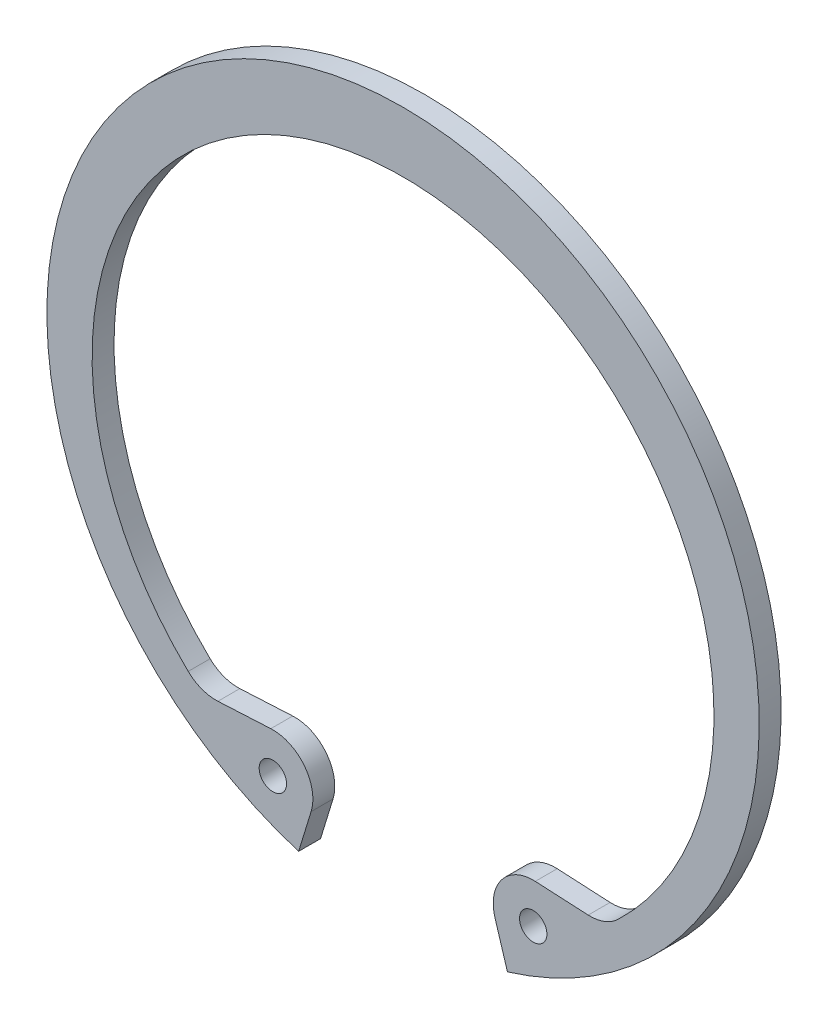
ISO-10303-21;
HEADER;
FILE_DESCRIPTION(('STEP AP214'),'2;1');
FILE_NAME('part.step','',(''),(''),'','','');
FILE_SCHEMA(('AUTOMOTIVE_DESIGN { 1 0 10303 214 1 1 1 1 }'));
ENDSEC;
DATA;
#1=APPLICATION_CONTEXT('core data for automotive mechanical design processes');
#2=APPLICATION_PROTOCOL_DEFINITION('international standard','automotive_design',2000,#1);
#3=PRODUCT_CONTEXT('',#1,'mechanical');
#4=PRODUCT('Part','Part','',(#3));
#5=PRODUCT_RELATED_PRODUCT_CATEGORY('part','',(#4));
#6=PRODUCT_DEFINITION_FORMATION('','',#4);
#7=PRODUCT_DEFINITION_CONTEXT('part definition',#1,'design');
#8=PRODUCT_DEFINITION('design','',#6,#7);
#9=PRODUCT_DEFINITION_SHAPE('','',#8);
#10=(LENGTH_UNIT() NAMED_UNIT(*) SI_UNIT(.MILLI.,.METRE.));
#11=(NAMED_UNIT(*) PLANE_ANGLE_UNIT() SI_UNIT($,.RADIAN.));
#12=(NAMED_UNIT(*) SI_UNIT($,.STERADIAN.) SOLID_ANGLE_UNIT());
#13=UNCERTAINTY_MEASURE_WITH_UNIT(LENGTH_MEASURE(1.E-05),#10,'distance_accuracy_value','');
#14=(GEOMETRIC_REPRESENTATION_CONTEXT(3) GLOBAL_UNCERTAINTY_ASSIGNED_CONTEXT((#13)) GLOBAL_UNIT_ASSIGNED_CONTEXT((#10,
#11,#12)) REPRESENTATION_CONTEXT('',''));
#15=CARTESIAN_POINT('',(0.,0.,0.));
#16=DIRECTION('',(0.,0.,1.));
#17=DIRECTION('',(1.,0.,0.));
#18=AXIS2_PLACEMENT_3D('',#15,#16,#17);
#19=CARTESIAN_POINT('',(0.,0.,2.));
#20=DIRECTION('',(0.,0.,1.));
#21=DIRECTION('',(1.,0.,0.));
#22=AXIS2_PLACEMENT_3D('',#19,#20,#21);
#23=PLANE('',#22);
#24=CARTESIAN_POINT('',(11.8788394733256,-26.2909808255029,2.));
#25=DIRECTION('',(0.,0.,1.));
#26=DIRECTION('',(1.,0.,0.));
#27=AXIS2_PLACEMENT_3D('',#24,#25,#26);
#28=CIRCLE('',#27,1.25);
#29=CARTESIAN_POINT('',(10.6288394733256,-26.2909808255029,2.));
#30=VERTEX_POINT('',#29);
#31=EDGE_CURVE('E145',#30,#30,#28,.T.);
#32=ORIENTED_EDGE('',*,*,#31,.F.);
#33=EDGE_LOOP('',(#32));
#34=FACE_BOUND('',#33,.T.);
#35=CARTESIAN_POINT('',(0.,0.,2.));
#36=DIRECTION('',(0.,0.,1.));
#37=DIRECTION('',(1.,0.,0.));
#38=AXIS2_PLACEMENT_3D('',#35,#36,#37);
#39=CIRCLE('',#38,32.5);
#40=CARTESIAN_POINT('',(9.52711331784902,-31.0722402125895,2.));
#41=VERTEX_POINT('',#40);
#42=CARTESIAN_POINT('',(-9.52711331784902,-31.0722402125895,2.));
#43=VERTEX_POINT('',#42);
#44=EDGE_CURVE('E160',#41,#43,#39,.T.);
#45=ORIENTED_EDGE('',*,*,#44,.T.);
#46=DIRECTION('',(0.293141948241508,0.956068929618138,0.));
#47=VECTOR('',#46,1.);
#48=CARTESIAN_POINT('',(-8.38918788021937,-27.3609489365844,2.));
#49=LINE('',#48,#47);
#50=CARTESIAN_POINT('',(-8.38918788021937,-27.3609489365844,2.));
#51=VERTEX_POINT('',#50);
#52=EDGE_CURVE('E98',#43,#51,#49,.T.);
#53=ORIENTED_EDGE('',*,*,#52,.T.);
#54=CARTESIAN_POINT('',(-11.8788394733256,-26.2909808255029,2.));
#55=DIRECTION('',(0.,0.,1.));
#56=DIRECTION('',(-1.,0.,0.));
#57=AXIS2_PLACEMENT_3D('',#54,#55,#56);
#58=CIRCLE('',#57,3.65);
#59=CARTESIAN_POINT('',(-12.0669294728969,-22.6458303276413,2.));
#60=VERTEX_POINT('',#59);
#61=EDGE_CURVE('E181',#51,#60,#58,.T.);
#62=ORIENTED_EDGE('',*,*,#61,.T.);
#63=DIRECTION('',(-0.998671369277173,-0.0515315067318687,0.));
#64=VECTOR('',#63,1.);
#65=CARTESIAN_POINT('',(-16.8945801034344,-22.8949374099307,2.));
#66=LINE('',#65,#64);
#67=CARTESIAN_POINT('',(-16.8945801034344,-22.8949374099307,2.));
#68=VERTEX_POINT('',#67);
#69=EDGE_CURVE('E200',#60,#68,#66,.T.);
#70=ORIENTED_EDGE('',*,*,#69,.T.);
#71=CARTESIAN_POINT('',(-17.0826701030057,-19.249786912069,2.));
#72=DIRECTION('',(0.,0.,-1.));
#73=DIRECTION('',(-1.,0.,0.));
#74=AXIS2_PLACEMENT_3D('',#71,#72,#73);
#75=CIRCLE('',#74,3.65000000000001);
#76=CARTESIAN_POINT('',(-19.6044798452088,-21.8885319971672,2.));
#77=VERTEX_POINT('',#76);
#78=EDGE_CURVE('E197',#68,#77,#75,.T.);
#79=ORIENTED_EDGE('',*,*,#78,.T.);
#80=CARTESIAN_POINT('',(0.,-1.37499999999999,2.));
#81=DIRECTION('',(0.,0.,-1.));
#82=DIRECTION('',(1.,0.,0.));
#83=AXIS2_PLACEMENT_3D('',#80,#81,#82);
#84=CIRCLE('',#83,28.375);
#85=CARTESIAN_POINT('',(19.6044798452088,-21.8885319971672,2.));
#86=VERTEX_POINT('',#85);
#87=EDGE_CURVE('E199',#77,#86,#84,.T.);
#88=ORIENTED_EDGE('',*,*,#87,.T.);
#89=CARTESIAN_POINT('',(17.0826701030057,-19.249786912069,2.));
#90=DIRECTION('',(0.,0.,-1.));
#91=DIRECTION('',(1.,0.,0.));
#92=AXIS2_PLACEMENT_3D('',#89,#90,#91);
#93=CIRCLE('',#92,3.65000000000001);
#94=CARTESIAN_POINT('',(16.8945801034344,-22.8949374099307,2.));
#95=VERTEX_POINT('',#94);
#96=EDGE_CURVE('E123',#86,#95,#93,.T.);
#97=ORIENTED_EDGE('',*,*,#96,.T.);
#98=DIRECTION('',(-0.998671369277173,0.0515315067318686,0.));
#99=VECTOR('',#98,1.);
#100=CARTESIAN_POINT('',(16.8945801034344,-22.8949374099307,2.));
#101=LINE('',#100,#99);
#102=CARTESIAN_POINT('',(12.0669294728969,-22.6458303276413,2.));
#103=VERTEX_POINT('',#102);
#104=EDGE_CURVE('E117',#95,#103,#101,.T.);
#105=ORIENTED_EDGE('',*,*,#104,.T.);
#106=CARTESIAN_POINT('',(11.8788394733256,-26.2909808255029,2.));
#107=DIRECTION('',(0.,0.,1.));
#108=DIRECTION('',(1.,0.,0.));
#109=AXIS2_PLACEMENT_3D('',#106,#107,#108);
#110=CIRCLE('',#109,3.65);
#111=CARTESIAN_POINT('',(8.38918788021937,-27.3609489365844,2.));
#112=VERTEX_POINT('',#111);
#113=EDGE_CURVE('E121',#103,#112,#110,.T.);
#114=ORIENTED_EDGE('',*,*,#113,.T.);
#115=DIRECTION('',(0.293141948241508,-0.956068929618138,0.));
#116=VECTOR('',#115,1.);
#117=CARTESIAN_POINT('',(8.38918788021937,-27.3609489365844,2.));
#118=LINE('',#117,#116);
#119=EDGE_CURVE('E49',#112,#41,#118,.T.);
#120=ORIENTED_EDGE('',*,*,#119,.T.);
#121=EDGE_LOOP('',(#45,#53,#62,#70,#79,#88,#97,#105,#114,#120));
#122=FACE_BOUND('',#121,.T.);
#123=CARTESIAN_POINT('',(-11.8788394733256,-26.2909808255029,2.));
#124=DIRECTION('',(0.,0.,1.));
#125=DIRECTION('',(-1.,0.,0.));
#126=AXIS2_PLACEMENT_3D('',#123,#124,#125);
#127=CIRCLE('',#126,1.25);
#128=CARTESIAN_POINT('',(-13.1288394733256,-26.2909808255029,2.));
#129=VERTEX_POINT('',#128);
#130=EDGE_CURVE('E211',#129,#129,#127,.T.);
#131=ORIENTED_EDGE('',*,*,#130,.F.);
#132=EDGE_LOOP('',(#131));
#133=FACE_BOUND('',#132,.T.);
#134=ADVANCED_FACE('F32',(#34,#122,#133),#23,.T.);
#135=CARTESIAN_POINT('',(0.,0.,0.));
#136=DIRECTION('',(0.,0.,1.));
#137=DIRECTION('',(1.,0.,0.));
#138=AXIS2_PLACEMENT_3D('',#135,#136,#137);
#139=PLANE('',#138);
#140=CARTESIAN_POINT('',(11.8788394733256,-26.2909808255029,0.));
#141=DIRECTION('',(0.,0.,1.));
#142=DIRECTION('',(1.,0.,0.));
#143=AXIS2_PLACEMENT_3D('',#140,#141,#142);
#144=CIRCLE('',#143,1.25);
#145=CARTESIAN_POINT('',(10.6288394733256,-26.2909808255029,0.));
#146=VERTEX_POINT('',#145);
#147=EDGE_CURVE('E208',#146,#146,#144,.T.);
#148=ORIENTED_EDGE('',*,*,#147,.T.);
#149=EDGE_LOOP('',(#148));
#150=FACE_BOUND('',#149,.T.);
#151=CARTESIAN_POINT('',(0.,0.,0.));
#152=DIRECTION('',(0.,0.,1.));
#153=DIRECTION('',(1.,0.,0.));
#154=AXIS2_PLACEMENT_3D('',#151,#152,#153);
#155=CIRCLE('',#154,32.5);
#156=CARTESIAN_POINT('',(9.52711331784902,-31.0722402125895,0.));
#157=VERTEX_POINT('',#156);
#158=CARTESIAN_POINT('',(-9.52711331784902,-31.0722402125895,0.));
#159=VERTEX_POINT('',#158);
#160=EDGE_CURVE('E141',#157,#159,#155,.T.);
#161=ORIENTED_EDGE('',*,*,#160,.F.);
#162=DIRECTION('',(0.293141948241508,-0.956068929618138,0.));
#163=VECTOR('',#162,1.);
#164=CARTESIAN_POINT('',(8.38918788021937,-27.3609489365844,0.));
#165=LINE('',#164,#163);
#166=CARTESIAN_POINT('',(8.38918788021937,-27.3609489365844,0.));
#167=VERTEX_POINT('',#166);
#168=EDGE_CURVE('E90',#167,#157,#165,.T.);
#169=ORIENTED_EDGE('',*,*,#168,.F.);
#170=CARTESIAN_POINT('',(11.8788394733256,-26.2909808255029,0.));
#171=DIRECTION('',(0.,0.,1.));
#172=DIRECTION('',(1.,0.,0.));
#173=AXIS2_PLACEMENT_3D('',#170,#171,#172);
#174=CIRCLE('',#173,3.65);
#175=CARTESIAN_POINT('',(12.0669294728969,-22.6458303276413,0.));
#176=VERTEX_POINT('',#175);
#177=EDGE_CURVE('E84',#176,#167,#174,.T.);
#178=ORIENTED_EDGE('',*,*,#177,.F.);
#179=DIRECTION('',(-0.998671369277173,0.0515315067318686,0.));
#180=VECTOR('',#179,1.);
#181=CARTESIAN_POINT('',(16.8945801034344,-22.8949374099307,0.));
#182=LINE('',#181,#180);
#183=CARTESIAN_POINT('',(16.8945801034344,-22.8949374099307,0.));
#184=VERTEX_POINT('',#183);
#185=EDGE_CURVE('E131',#184,#176,#182,.T.);
#186=ORIENTED_EDGE('',*,*,#185,.F.);
#187=CARTESIAN_POINT('',(17.0826701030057,-19.249786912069,0.));
#188=DIRECTION('',(0.,0.,-1.));
#189=DIRECTION('',(1.,0.,0.));
#190=AXIS2_PLACEMENT_3D('',#187,#188,#189);
#191=CIRCLE('',#190,3.65000000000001);
#192=CARTESIAN_POINT('',(19.6044798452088,-21.8885319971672,0.));
#193=VERTEX_POINT('',#192);
#194=EDGE_CURVE('E155',#193,#184,#191,.T.);
#195=ORIENTED_EDGE('',*,*,#194,.F.);
#196=CARTESIAN_POINT('',(0.,-1.37499999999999,0.));
#197=DIRECTION('',(0.,0.,-1.));
#198=DIRECTION('',(1.,0.,0.));
#199=AXIS2_PLACEMENT_3D('',#196,#197,#198);
#200=CIRCLE('',#199,28.375);
#201=CARTESIAN_POINT('',(-19.6044798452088,-21.8885319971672,0.));
#202=VERTEX_POINT('',#201);
#203=EDGE_CURVE('E153',#202,#193,#200,.T.);
#204=ORIENTED_EDGE('',*,*,#203,.F.);
#205=CARTESIAN_POINT('',(-17.0826701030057,-19.249786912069,0.));
#206=DIRECTION('',(0.,0.,-1.));
#207=DIRECTION('',(-1.,0.,0.));
#208=AXIS2_PLACEMENT_3D('',#205,#206,#207);
#209=CIRCLE('',#208,3.65000000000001);
#210=CARTESIAN_POINT('',(-16.8945801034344,-22.8949374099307,0.));
#211=VERTEX_POINT('',#210);
#212=EDGE_CURVE('E151',#211,#202,#209,.T.);
#213=ORIENTED_EDGE('',*,*,#212,.F.);
#214=DIRECTION('',(-0.998671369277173,-0.0515315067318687,0.));
#215=VECTOR('',#214,1.);
#216=CARTESIAN_POINT('',(-16.8945801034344,-22.8949374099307,0.));
#217=LINE('',#216,#215);
#218=CARTESIAN_POINT('',(-12.0669294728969,-22.6458303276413,0.));
#219=VERTEX_POINT('',#218);
#220=EDGE_CURVE('E149',#219,#211,#217,.T.);
#221=ORIENTED_EDGE('',*,*,#220,.F.);
#222=CARTESIAN_POINT('',(-11.8788394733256,-26.2909808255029,0.));
#223=DIRECTION('',(0.,0.,1.));
#224=DIRECTION('',(-1.,0.,0.));
#225=AXIS2_PLACEMENT_3D('',#222,#223,#224);
#226=CIRCLE('',#225,3.65);
#227=CARTESIAN_POINT('',(-8.38918788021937,-27.3609489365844,0.));
#228=VERTEX_POINT('',#227);
#229=EDGE_CURVE('E147',#228,#219,#226,.T.);
#230=ORIENTED_EDGE('',*,*,#229,.F.);
#231=DIRECTION('',(0.293141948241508,0.956068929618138,0.));
#232=VECTOR('',#231,1.);
#233=CARTESIAN_POINT('',(-8.38918788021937,-27.3609489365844,0.));
#234=LINE('',#233,#232);
#235=EDGE_CURVE('E144',#159,#228,#234,.T.);
#236=ORIENTED_EDGE('',*,*,#235,.F.);
#237=EDGE_LOOP('',(#161,#169,#178,#186,#195,#204,#213,#221,#230,#236));
#238=FACE_BOUND('',#237,.T.);
#239=CARTESIAN_POINT('',(-11.8788394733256,-26.2909808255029,0.));
#240=DIRECTION('',(0.,0.,1.));
#241=DIRECTION('',(-1.,0.,0.));
#242=AXIS2_PLACEMENT_3D('',#239,#240,#241);
#243=CIRCLE('',#242,1.25);
#244=CARTESIAN_POINT('',(-13.1288394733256,-26.2909808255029,0.));
#245=VERTEX_POINT('',#244);
#246=EDGE_CURVE('E214',#245,#245,#243,.T.);
#247=ORIENTED_EDGE('',*,*,#246,.T.);
#248=EDGE_LOOP('',(#247));
#249=FACE_BOUND('',#248,.T.);
#250=ADVANCED_FACE('F185',(#150,#238,#249),#139,.F.);
#251=CARTESIAN_POINT('',(0.,0.,2.));
#252=DIRECTION('',(0.,0.,-1.));
#253=DIRECTION('',(-1.,0.,0.));
#254=AXIS2_PLACEMENT_3D('',#251,#252,#253);
#255=CYLINDRICAL_SURFACE('',#254,32.5);
#256=ORIENTED_EDGE('',*,*,#160,.T.);
#257=DIRECTION('',(0.,0.,-1.));
#258=VECTOR('',#257,1.);
#259=CARTESIAN_POINT('',(-9.52711331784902,-31.0722402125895,2.));
#260=LINE('',#259,#258);
#261=EDGE_CURVE('E11',#43,#159,#260,.T.);
#262=ORIENTED_EDGE('',*,*,#261,.F.);
#263=ORIENTED_EDGE('',*,*,#44,.F.);
#264=DIRECTION('',(0.,0.,-1.));
#265=VECTOR('',#264,1.);
#266=CARTESIAN_POINT('',(9.52711331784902,-31.0722402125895,2.));
#267=LINE('',#266,#265);
#268=EDGE_CURVE('E137',#41,#157,#267,.T.);
#269=ORIENTED_EDGE('',*,*,#268,.T.);
#270=EDGE_LOOP('',(#256,#262,#263,#269));
#271=FACE_BOUND('',#270,.T.);
#272=ADVANCED_FACE('F34',(#271),#255,.T.);
#273=CARTESIAN_POINT('',(-8.38918788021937,-27.3609489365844,2.));
#274=DIRECTION('',(-0.956068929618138,0.293141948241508,0.));
#275=DIRECTION('',(-0.293141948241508,-0.956068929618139,0.));
#276=AXIS2_PLACEMENT_3D('',#273,#274,#275);
#277=PLANE('',#276);
#278=ORIENTED_EDGE('',*,*,#235,.T.);
#279=DIRECTION('',(0.,0.,-1.));
#280=VECTOR('',#279,1.);
#281=CARTESIAN_POINT('',(-8.38918788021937,-27.3609489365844,2.));
#282=LINE('',#281,#280);
#283=EDGE_CURVE('E41',#51,#228,#282,.T.);
#284=ORIENTED_EDGE('',*,*,#283,.F.);
#285=ORIENTED_EDGE('',*,*,#52,.F.);
#286=ORIENTED_EDGE('',*,*,#261,.T.);
#287=EDGE_LOOP('',(#278,#284,#285,#286));
#288=FACE_BOUND('',#287,.T.);
#289=ADVANCED_FACE('F255',(#288),#277,.F.);
#290=CARTESIAN_POINT('',(-11.8788394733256,-26.2909808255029,2.));
#291=DIRECTION('',(0.,0.,-1.));
#292=DIRECTION('',(-1.,0.,0.));
#293=AXIS2_PLACEMENT_3D('',#290,#291,#292);
#294=CYLINDRICAL_SURFACE('',#293,3.65);
#295=ORIENTED_EDGE('',*,*,#229,.T.);
#296=DIRECTION('',(0.,0.,-1.));
#297=VECTOR('',#296,1.);
#298=CARTESIAN_POINT('',(-12.0669294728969,-22.6458303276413,2.));
#299=LINE('',#298,#297);
#300=EDGE_CURVE('E173',#60,#219,#299,.T.);
#301=ORIENTED_EDGE('',*,*,#300,.F.);
#302=ORIENTED_EDGE('',*,*,#61,.F.);
#303=ORIENTED_EDGE('',*,*,#283,.T.);
#304=EDGE_LOOP('',(#295,#301,#302,#303));
#305=FACE_BOUND('',#304,.T.);
#306=ADVANCED_FACE('F179',(#305),#294,.T.);
#307=CARTESIAN_POINT('',(-16.8945801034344,-22.8949374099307,2.));
#308=DIRECTION('',(0.0515315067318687,-0.998671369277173,0.));
#309=DIRECTION('',(0.998671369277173,0.0515315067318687,0.));
#310=AXIS2_PLACEMENT_3D('',#307,#308,#309);
#311=PLANE('',#310);
#312=ORIENTED_EDGE('',*,*,#220,.T.);
#313=DIRECTION('',(0.,0.,-1.));
#314=VECTOR('',#313,1.);
#315=CARTESIAN_POINT('',(-16.8945801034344,-22.8949374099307,2.));
#316=LINE('',#315,#314);
#317=EDGE_CURVE('E170',#68,#211,#316,.T.);
#318=ORIENTED_EDGE('',*,*,#317,.F.);
#319=ORIENTED_EDGE('',*,*,#69,.F.);
#320=ORIENTED_EDGE('',*,*,#300,.T.);
#321=EDGE_LOOP('',(#312,#318,#319,#320));
#322=FACE_BOUND('',#321,.T.);
#323=ADVANCED_FACE('F191',(#322),#311,.F.);
#324=CARTESIAN_POINT('',(-17.0826701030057,-19.249786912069,2.));
#325=DIRECTION('',(0.,0.,-1.));
#326=DIRECTION('',(-1.,0.,0.));
#327=AXIS2_PLACEMENT_3D('',#324,#325,#326);
#328=CYLINDRICAL_SURFACE('',#327,3.65000000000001);
#329=ORIENTED_EDGE('',*,*,#212,.T.);
#330=DIRECTION('',(0.,0.,-1.));
#331=VECTOR('',#330,1.);
#332=CARTESIAN_POINT('',(-19.6044798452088,-21.8885319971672,2.));
#333=LINE('',#332,#331);
#334=EDGE_CURVE('E167',#77,#202,#333,.T.);
#335=ORIENTED_EDGE('',*,*,#334,.F.);
#336=ORIENTED_EDGE('',*,*,#78,.F.);
#337=ORIENTED_EDGE('',*,*,#317,.T.);
#338=EDGE_LOOP('',(#329,#335,#336,#337));
#339=FACE_BOUND('',#338,.T.);
#340=ADVANCED_FACE('F195',(#339),#328,.F.);
#341=CARTESIAN_POINT('',(0.,-1.37499999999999,2.));
#342=DIRECTION('',(0.,0.,-1.));
#343=DIRECTION('',(-1.,0.,0.));
#344=AXIS2_PLACEMENT_3D('',#341,#342,#343);
#345=CYLINDRICAL_SURFACE('',#344,28.375);
#346=ORIENTED_EDGE('',*,*,#203,.T.);
#347=DIRECTION('',(0.,0.,-1.));
#348=VECTOR('',#347,1.);
#349=CARTESIAN_POINT('',(19.6044798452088,-21.8885319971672,2.));
#350=LINE('',#349,#348);
#351=EDGE_CURVE('E164',#86,#193,#350,.T.);
#352=ORIENTED_EDGE('',*,*,#351,.F.);
#353=ORIENTED_EDGE('',*,*,#87,.F.);
#354=ORIENTED_EDGE('',*,*,#334,.T.);
#355=EDGE_LOOP('',(#346,#352,#353,#354));
#356=FACE_BOUND('',#355,.T.);
#357=ADVANCED_FACE('F245',(#356),#345,.F.);
#358=CARTESIAN_POINT('',(17.0826701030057,-19.249786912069,2.));
#359=DIRECTION('',(0.,0.,-1.));
#360=DIRECTION('',(-1.,0.,0.));
#361=AXIS2_PLACEMENT_3D('',#358,#359,#360);
#362=CYLINDRICAL_SURFACE('',#361,3.65000000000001);
#363=ORIENTED_EDGE('',*,*,#194,.T.);
#364=DIRECTION('',(0.,0.,-1.));
#365=VECTOR('',#364,1.);
#366=CARTESIAN_POINT('',(16.8945801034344,-22.8949374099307,2.));
#367=LINE('',#366,#365);
#368=EDGE_CURVE('E132',#95,#184,#367,.T.);
#369=ORIENTED_EDGE('',*,*,#368,.F.);
#370=ORIENTED_EDGE('',*,*,#96,.F.);
#371=ORIENTED_EDGE('',*,*,#351,.T.);
#372=EDGE_LOOP('',(#363,#369,#370,#371));
#373=FACE_BOUND('',#372,.T.);
#374=ADVANCED_FACE('F242',(#373),#362,.F.);
#375=CARTESIAN_POINT('',(16.8945801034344,-22.8949374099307,2.));
#376=DIRECTION('',(-0.0515315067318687,-0.998671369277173,0.));
#377=DIRECTION('',(0.998671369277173,-0.0515315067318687,0.));
#378=AXIS2_PLACEMENT_3D('',#375,#376,#377);
#379=PLANE('',#378);
#380=ORIENTED_EDGE('',*,*,#185,.T.);
#381=DIRECTION('',(0.,0.,-1.));
#382=VECTOR('',#381,1.);
#383=CARTESIAN_POINT('',(12.0669294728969,-22.6458303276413,2.));
#384=LINE('',#383,#382);
#385=EDGE_CURVE('E128',#103,#176,#384,.T.);
#386=ORIENTED_EDGE('',*,*,#385,.F.);
#387=ORIENTED_EDGE('',*,*,#104,.F.);
#388=ORIENTED_EDGE('',*,*,#368,.T.);
#389=EDGE_LOOP('',(#380,#386,#387,#388));
#390=FACE_BOUND('',#389,.T.);
#391=ADVANCED_FACE('F129',(#390),#379,.F.);
#392=CARTESIAN_POINT('',(11.8788394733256,-26.2909808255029,2.));
#393=DIRECTION('',(0.,0.,-1.));
#394=DIRECTION('',(-1.,0.,0.));
#395=AXIS2_PLACEMENT_3D('',#392,#393,#394);
#396=CYLINDRICAL_SURFACE('',#395,3.65);
#397=ORIENTED_EDGE('',*,*,#177,.T.);
#398=DIRECTION('',(0.,0.,-1.));
#399=VECTOR('',#398,1.);
#400=CARTESIAN_POINT('',(8.38918788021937,-27.3609489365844,2.));
#401=LINE('',#400,#399);
#402=EDGE_CURVE('E133',#112,#167,#401,.T.);
#403=ORIENTED_EDGE('',*,*,#402,.F.);
#404=ORIENTED_EDGE('',*,*,#113,.F.);
#405=ORIENTED_EDGE('',*,*,#385,.T.);
#406=EDGE_LOOP('',(#397,#403,#404,#405));
#407=FACE_BOUND('',#406,.T.);
#408=ADVANCED_FACE('F135',(#407),#396,.T.);
#409=CARTESIAN_POINT('',(8.38918788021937,-27.3609489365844,2.));
#410=DIRECTION('',(0.956068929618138,0.293141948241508,0.));
#411=DIRECTION('',(-0.293141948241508,0.956068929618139,0.));
#412=AXIS2_PLACEMENT_3D('',#409,#410,#411);
#413=PLANE('',#412);
#414=ORIENTED_EDGE('',*,*,#168,.T.);
#415=ORIENTED_EDGE('',*,*,#268,.F.);
#416=ORIENTED_EDGE('',*,*,#119,.F.);
#417=ORIENTED_EDGE('',*,*,#402,.T.);
#418=EDGE_LOOP('',(#414,#415,#416,#417));
#419=FACE_BOUND('',#418,.T.);
#420=ADVANCED_FACE('F235',(#419),#413,.F.);
#421=CARTESIAN_POINT('',(11.8788394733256,-26.2909808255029,2.));
#422=DIRECTION('',(0.,0.,-1.));
#423=DIRECTION('',(-1.,0.,0.));
#424=AXIS2_PLACEMENT_3D('',#421,#422,#423);
#425=CYLINDRICAL_SURFACE('',#424,1.25);
#426=CARTESIAN_POINT('',(10.6288394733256,-26.2909808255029,2.));
#427=CARTESIAN_POINT('',(10.6288394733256,-26.2909808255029,1.97916666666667));
#428=CARTESIAN_POINT('',(10.6288394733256,-26.2909808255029,1.95833333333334));
#429=CARTESIAN_POINT('',(10.6288394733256,-26.2909808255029,1.91666666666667));
#430=CARTESIAN_POINT('',(10.6288394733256,-26.2909808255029,1.89583333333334));
#431=CARTESIAN_POINT('',(10.6288394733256,-26.2909808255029,1.85416666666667));
#432=CARTESIAN_POINT('',(10.6288394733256,-26.2909808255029,1.83333333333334));
#433=CARTESIAN_POINT('',(10.6288394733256,-26.2909808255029,1.79166666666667));
#434=CARTESIAN_POINT('',(10.6288394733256,-26.2909808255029,1.77083333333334));
#435=CARTESIAN_POINT('',(10.6288394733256,-26.2909808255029,1.72916666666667));
#436=CARTESIAN_POINT('',(10.6288394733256,-26.2909808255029,1.70833333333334));
#437=CARTESIAN_POINT('',(10.6288394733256,-26.2909808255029,1.66666666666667));
#438=CARTESIAN_POINT('',(10.6288394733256,-26.2909808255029,1.64583333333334));
#439=CARTESIAN_POINT('',(10.6288394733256,-26.2909808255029,1.60416666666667));
#440=CARTESIAN_POINT('',(10.6288394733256,-26.2909808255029,1.58333333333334));
#441=CARTESIAN_POINT('',(10.6288394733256,-26.2909808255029,1.54166666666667));
#442=CARTESIAN_POINT('',(10.6288394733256,-26.2909808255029,1.52083333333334));
#443=CARTESIAN_POINT('',(10.6288394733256,-26.2909808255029,1.47916666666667));
#444=CARTESIAN_POINT('',(10.6288394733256,-26.2909808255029,1.45833333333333));
#445=CARTESIAN_POINT('',(10.6288394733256,-26.2909808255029,1.41666666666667));
#446=CARTESIAN_POINT('',(10.6288394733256,-26.2909808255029,1.39583333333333));
#447=CARTESIAN_POINT('',(10.6288394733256,-26.2909808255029,1.35416666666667));
#448=CARTESIAN_POINT('',(10.6288394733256,-26.2909808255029,1.33333333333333));
#449=CARTESIAN_POINT('',(10.6288394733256,-26.2909808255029,1.29166666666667));
#450=CARTESIAN_POINT('',(10.6288394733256,-26.2909808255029,1.27083333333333));
#451=CARTESIAN_POINT('',(10.6288394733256,-26.2909808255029,1.22916666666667));
#452=CARTESIAN_POINT('',(10.6288394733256,-26.2909808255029,1.20833333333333));
#453=CARTESIAN_POINT('',(10.6288394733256,-26.2909808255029,1.16666666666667));
#454=CARTESIAN_POINT('',(10.6288394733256,-26.2909808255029,1.14583333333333));
#455=CARTESIAN_POINT('',(10.6288394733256,-26.2909808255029,1.10416666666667));
#456=CARTESIAN_POINT('',(10.6288394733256,-26.2909808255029,1.08333333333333));
#457=CARTESIAN_POINT('',(10.6288394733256,-26.2909808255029,1.04166666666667));
#458=CARTESIAN_POINT('',(10.6288394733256,-26.2909808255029,1.02083333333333));
#459=CARTESIAN_POINT('',(10.6288394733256,-26.2909808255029,0.979166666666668));
#460=CARTESIAN_POINT('',(10.6288394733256,-26.2909808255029,0.958333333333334));
#461=CARTESIAN_POINT('',(10.6288394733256,-26.2909808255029,0.916666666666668));
#462=CARTESIAN_POINT('',(10.6288394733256,-26.2909808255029,0.895833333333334));
#463=CARTESIAN_POINT('',(10.6288394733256,-26.2909808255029,0.854166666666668));
#464=CARTESIAN_POINT('',(10.6288394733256,-26.2909808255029,0.833333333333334));
#465=CARTESIAN_POINT('',(10.6288394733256,-26.2909808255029,0.791666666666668));
#466=CARTESIAN_POINT('',(10.6288394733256,-26.2909808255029,0.770833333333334));
#467=CARTESIAN_POINT('',(10.6288394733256,-26.2909808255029,0.729166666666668));
#468=CARTESIAN_POINT('',(10.6288394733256,-26.2909808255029,0.708333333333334));
#469=CARTESIAN_POINT('',(10.6288394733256,-26.2909808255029,0.666666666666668));
#470=CARTESIAN_POINT('',(10.6288394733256,-26.2909808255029,0.645833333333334));
#471=CARTESIAN_POINT('',(10.6288394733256,-26.2909808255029,0.604166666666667));
#472=CARTESIAN_POINT('',(10.6288394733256,-26.2909808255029,0.583333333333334));
#473=CARTESIAN_POINT('',(10.6288394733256,-26.2909808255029,0.541666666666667));
#474=CARTESIAN_POINT('',(10.6288394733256,-26.2909808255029,0.520833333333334));
#475=CARTESIAN_POINT('',(10.6288394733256,-26.2909808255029,0.479166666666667));
#476=CARTESIAN_POINT('',(10.6288394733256,-26.2909808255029,0.458333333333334));
#477=CARTESIAN_POINT('',(10.6288394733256,-26.2909808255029,0.416666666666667));
#478=CARTESIAN_POINT('',(10.6288394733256,-26.2909808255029,0.395833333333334));
#479=CARTESIAN_POINT('',(10.6288394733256,-26.2909808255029,0.354166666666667));
#480=CARTESIAN_POINT('',(10.6288394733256,-26.2909808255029,0.333333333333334));
#481=CARTESIAN_POINT('',(10.6288394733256,-26.2909808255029,0.291666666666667));
#482=CARTESIAN_POINT('',(10.6288394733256,-26.2909808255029,0.270833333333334));
#483=CARTESIAN_POINT('',(10.6288394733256,-26.2909808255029,0.229166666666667));
#484=CARTESIAN_POINT('',(10.6288394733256,-26.2909808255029,0.208333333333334));
#485=CARTESIAN_POINT('',(10.6288394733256,-26.2909808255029,0.166666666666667));
#486=CARTESIAN_POINT('',(10.6288394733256,-26.2909808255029,0.145833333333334));
#487=CARTESIAN_POINT('',(10.6288394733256,-26.2909808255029,0.104166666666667));
#488=CARTESIAN_POINT('',(10.6288394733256,-26.2909808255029,0.0833333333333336));
#489=CARTESIAN_POINT('',(10.6288394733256,-26.2909808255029,0.041666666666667));
#490=CARTESIAN_POINT('',(10.6288394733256,-26.2909808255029,0.0208333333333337));
#491=CARTESIAN_POINT('',(10.6288394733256,-26.2909808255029,0.));
#492=B_SPLINE_CURVE_WITH_KNOTS('',3,(#426,#427,#428,#429,#430,#431,#432,#433,#434,#435,#436,
#437,#438,#439,#440,#441,#442,#443,#444,#445,#446,#447,#448,#449,#450,#451,#452,#453,#454,#455,
#456,#457,#458,#459,#460,#461,#462,#463,#464,#465,#466,#467,#468,#469,#470,#471,#472,#473,#474,
#475,#476,#477,#478,#479,#480,#481,#482,#483,#484,#485,#486,#487,#488,#489,#490,#491),
.UNSPECIFIED.,.F.,.F.,(4,2,2,2,2,2,2,2,2,2,2,2,2,2,2,2,2,2,2,2,2,2,2,2,2,2,2,2,2,2,2,2,4),(0.,
0.0625000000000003,0.125,0.1875,0.25,0.3125,0.375000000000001,0.437500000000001,
0.500000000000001,0.562500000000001,0.625000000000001,0.687500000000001,0.750000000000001,
0.812500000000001,0.875000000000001,0.937500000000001,1.,1.0625,1.125,1.1875,1.25,1.3125,1.375,
1.4375,1.5,1.5625,1.625,1.6875,1.75,1.8125,1.875,1.9375,2.),.UNSPECIFIED.);
#493=EDGE_CURVE('BSEAM232',#30,#146,#492,.T.);
#494=ORIENTED_EDGE('',*,*,#31,.T.);
#495=ORIENTED_EDGE('',*,*,#147,.F.);
#496=ORIENTED_EDGE('',*,*,#493,.T.);
#497=ORIENTED_EDGE('',*,*,#493,.F.);
#498=EDGE_LOOP('',(#494,#496,#495,#497));
#499=FACE_BOUND('',#498,.T.);
#500=ADVANCED_FACE('F232',(#499),#425,.F.);
#501=CARTESIAN_POINT('',(-11.8788394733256,-26.2909808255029,2.));
#502=DIRECTION('',(0.,0.,-1.));
#503=DIRECTION('',(-1.,0.,0.));
#504=AXIS2_PLACEMENT_3D('',#501,#502,#503);
#505=CYLINDRICAL_SURFACE('',#504,1.25);
#506=CARTESIAN_POINT('',(-13.1288394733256,-26.2909808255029,2.));
#507=CARTESIAN_POINT('',(-13.1288394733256,-26.2909808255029,1.97916666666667));
#508=CARTESIAN_POINT('',(-13.1288394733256,-26.2909808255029,1.95833333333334));
#509=CARTESIAN_POINT('',(-13.1288394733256,-26.2909808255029,1.91666666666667));
#510=CARTESIAN_POINT('',(-13.1288394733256,-26.2909808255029,1.89583333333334));
#511=CARTESIAN_POINT('',(-13.1288394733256,-26.2909808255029,1.85416666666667));
#512=CARTESIAN_POINT('',(-13.1288394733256,-26.2909808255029,1.83333333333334));
#513=CARTESIAN_POINT('',(-13.1288394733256,-26.2909808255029,1.79166666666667));
#514=CARTESIAN_POINT('',(-13.1288394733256,-26.2909808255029,1.77083333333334));
#515=CARTESIAN_POINT('',(-13.1288394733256,-26.2909808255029,1.72916666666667));
#516=CARTESIAN_POINT('',(-13.1288394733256,-26.2909808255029,1.70833333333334));
#517=CARTESIAN_POINT('',(-13.1288394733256,-26.2909808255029,1.66666666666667));
#518=CARTESIAN_POINT('',(-13.1288394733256,-26.2909808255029,1.64583333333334));
#519=CARTESIAN_POINT('',(-13.1288394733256,-26.2909808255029,1.60416666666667));
#520=CARTESIAN_POINT('',(-13.1288394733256,-26.2909808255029,1.58333333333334));
#521=CARTESIAN_POINT('',(-13.1288394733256,-26.2909808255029,1.54166666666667));
#522=CARTESIAN_POINT('',(-13.1288394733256,-26.2909808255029,1.52083333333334));
#523=CARTESIAN_POINT('',(-13.1288394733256,-26.2909808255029,1.47916666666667));
#524=CARTESIAN_POINT('',(-13.1288394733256,-26.2909808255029,1.45833333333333));
#525=CARTESIAN_POINT('',(-13.1288394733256,-26.2909808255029,1.41666666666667));
#526=CARTESIAN_POINT('',(-13.1288394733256,-26.2909808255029,1.39583333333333));
#527=CARTESIAN_POINT('',(-13.1288394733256,-26.2909808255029,1.35416666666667));
#528=CARTESIAN_POINT('',(-13.1288394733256,-26.2909808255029,1.33333333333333));
#529=CARTESIAN_POINT('',(-13.1288394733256,-26.2909808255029,1.29166666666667));
#530=CARTESIAN_POINT('',(-13.1288394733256,-26.2909808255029,1.27083333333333));
#531=CARTESIAN_POINT('',(-13.1288394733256,-26.2909808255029,1.22916666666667));
#532=CARTESIAN_POINT('',(-13.1288394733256,-26.2909808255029,1.20833333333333));
#533=CARTESIAN_POINT('',(-13.1288394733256,-26.2909808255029,1.16666666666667));
#534=CARTESIAN_POINT('',(-13.1288394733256,-26.2909808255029,1.14583333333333));
#535=CARTESIAN_POINT('',(-13.1288394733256,-26.2909808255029,1.10416666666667));
#536=CARTESIAN_POINT('',(-13.1288394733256,-26.2909808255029,1.08333333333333));
#537=CARTESIAN_POINT('',(-13.1288394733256,-26.2909808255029,1.04166666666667));
#538=CARTESIAN_POINT('',(-13.1288394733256,-26.2909808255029,1.02083333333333));
#539=CARTESIAN_POINT('',(-13.1288394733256,-26.2909808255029,0.979166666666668));
#540=CARTESIAN_POINT('',(-13.1288394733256,-26.2909808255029,0.958333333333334));
#541=CARTESIAN_POINT('',(-13.1288394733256,-26.2909808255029,0.916666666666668));
#542=CARTESIAN_POINT('',(-13.1288394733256,-26.2909808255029,0.895833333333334));
#543=CARTESIAN_POINT('',(-13.1288394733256,-26.2909808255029,0.854166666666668));
#544=CARTESIAN_POINT('',(-13.1288394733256,-26.2909808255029,0.833333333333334));
#545=CARTESIAN_POINT('',(-13.1288394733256,-26.2909808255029,0.791666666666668));
#546=CARTESIAN_POINT('',(-13.1288394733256,-26.2909808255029,0.770833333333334));
#547=CARTESIAN_POINT('',(-13.1288394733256,-26.2909808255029,0.729166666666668));
#548=CARTESIAN_POINT('',(-13.1288394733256,-26.2909808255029,0.708333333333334));
#549=CARTESIAN_POINT('',(-13.1288394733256,-26.2909808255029,0.666666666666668));
#550=CARTESIAN_POINT('',(-13.1288394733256,-26.2909808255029,0.645833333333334));
#551=CARTESIAN_POINT('',(-13.1288394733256,-26.2909808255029,0.604166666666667));
#552=CARTESIAN_POINT('',(-13.1288394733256,-26.2909808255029,0.583333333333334));
#553=CARTESIAN_POINT('',(-13.1288394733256,-26.2909808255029,0.541666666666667));
#554=CARTESIAN_POINT('',(-13.1288394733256,-26.2909808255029,0.520833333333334));
#555=CARTESIAN_POINT('',(-13.1288394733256,-26.2909808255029,0.479166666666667));
#556=CARTESIAN_POINT('',(-13.1288394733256,-26.2909808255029,0.458333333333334));
#557=CARTESIAN_POINT('',(-13.1288394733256,-26.2909808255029,0.416666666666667));
#558=CARTESIAN_POINT('',(-13.1288394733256,-26.2909808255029,0.395833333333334));
#559=CARTESIAN_POINT('',(-13.1288394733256,-26.2909808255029,0.354166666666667));
#560=CARTESIAN_POINT('',(-13.1288394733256,-26.2909808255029,0.333333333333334));
#561=CARTESIAN_POINT('',(-13.1288394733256,-26.2909808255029,0.291666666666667));
#562=CARTESIAN_POINT('',(-13.1288394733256,-26.2909808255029,0.270833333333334));
#563=CARTESIAN_POINT('',(-13.1288394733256,-26.2909808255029,0.229166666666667));
#564=CARTESIAN_POINT('',(-13.1288394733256,-26.2909808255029,0.208333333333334));
#565=CARTESIAN_POINT('',(-13.1288394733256,-26.2909808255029,0.166666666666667));
#566=CARTESIAN_POINT('',(-13.1288394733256,-26.2909808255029,0.145833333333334));
#567=CARTESIAN_POINT('',(-13.1288394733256,-26.2909808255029,0.104166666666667));
#568=CARTESIAN_POINT('',(-13.1288394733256,-26.2909808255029,0.0833333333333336));
#569=CARTESIAN_POINT('',(-13.1288394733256,-26.2909808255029,0.041666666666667));
#570=CARTESIAN_POINT('',(-13.1288394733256,-26.2909808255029,0.0208333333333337));
#571=CARTESIAN_POINT('',(-13.1288394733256,-26.2909808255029,0.));
#572=B_SPLINE_CURVE_WITH_KNOTS('',3,(#506,#507,#508,#509,#510,#511,#512,#513,#514,#515,#516,
#517,#518,#519,#520,#521,#522,#523,#524,#525,#526,#527,#528,#529,#530,#531,#532,#533,#534,#535,
#536,#537,#538,#539,#540,#541,#542,#543,#544,#545,#546,#547,#548,#549,#550,#551,#552,#553,#554,
#555,#556,#557,#558,#559,#560,#561,#562,#563,#564,#565,#566,#567,#568,#569,#570,#571),
.UNSPECIFIED.,.F.,.F.,(4,2,2,2,2,2,2,2,2,2,2,2,2,2,2,2,2,2,2,2,2,2,2,2,2,2,2,2,2,2,2,2,4),(0.,
0.0625000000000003,0.125,0.1875,0.25,0.3125,0.375000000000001,0.437500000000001,
0.500000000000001,0.562500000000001,0.625000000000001,0.687500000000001,0.750000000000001,
0.812500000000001,0.875000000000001,0.937500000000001,1.,1.0625,1.125,1.1875,1.25,1.3125,1.375,
1.4375,1.5,1.5625,1.625,1.6875,1.75,1.8125,1.875,1.9375,2.),.UNSPECIFIED.);
#573=EDGE_CURVE('BSEAM220',#129,#245,#572,.T.);
#574=ORIENTED_EDGE('',*,*,#130,.T.);
#575=ORIENTED_EDGE('',*,*,#246,.F.);
#576=ORIENTED_EDGE('',*,*,#573,.T.);
#577=ORIENTED_EDGE('',*,*,#573,.F.);
#578=EDGE_LOOP('',(#574,#576,#575,#577));
#579=FACE_BOUND('',#578,.T.);
#580=ADVANCED_FACE('F220',(#579),#505,.F.);
#581=CLOSED_SHELL('',(#134,#250,#272,#289,#306,#323,#340,#357,#374,#391,#408,#420,#500,#580));
#582=MANIFOLD_SOLID_BREP('B2',#581);
#583=ADVANCED_BREP_SHAPE_REPRESENTATION('',(#18,#582),#14);
#584=SHAPE_DEFINITION_REPRESENTATION(#9,#583);
ENDSEC;
END-ISO-10303-21;
